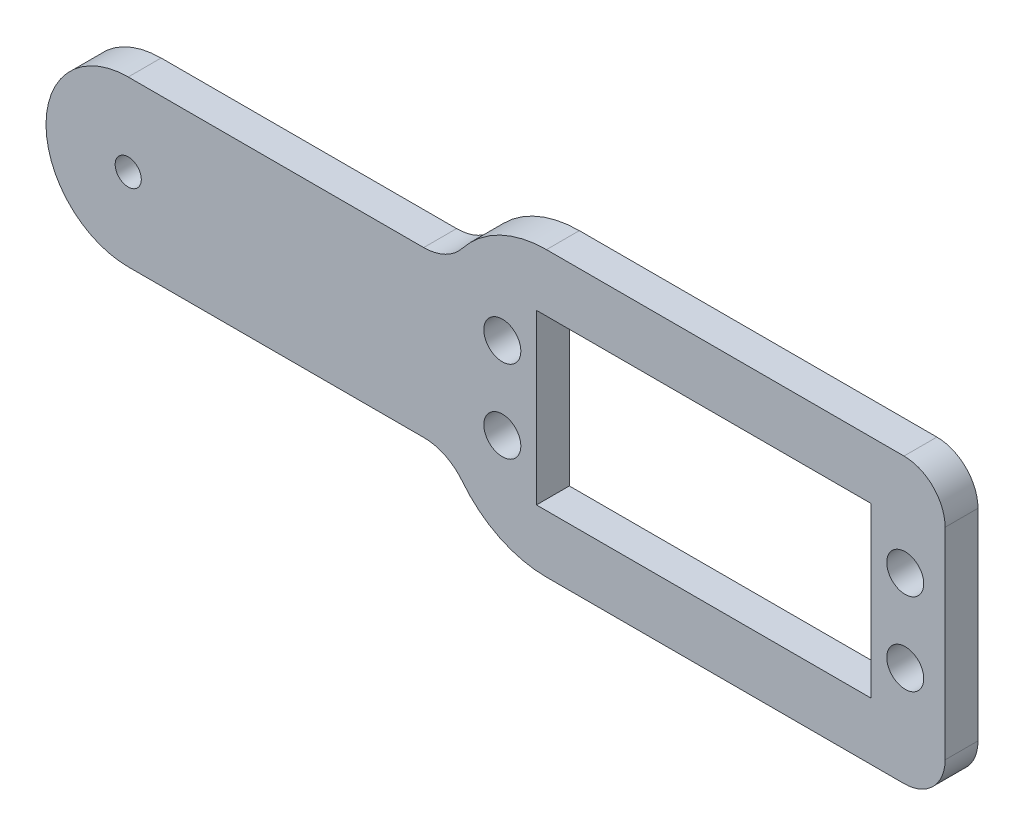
ISO-10303-21;
HEADER;
FILE_DESCRIPTION(('STEP AP214'),'2;1');
FILE_NAME('part.step','',(''),(''),'','','');
FILE_SCHEMA(('AUTOMOTIVE_DESIGN { 1 0 10303 214 1 1 1 1 }'));
ENDSEC;
DATA;
#1=APPLICATION_CONTEXT('core data for automotive mechanical design processes');
#2=APPLICATION_PROTOCOL_DEFINITION('international standard','automotive_design',2000,#1);
#3=PRODUCT_CONTEXT('',#1,'mechanical');
#4=PRODUCT('Part','Part','',(#3));
#5=PRODUCT_RELATED_PRODUCT_CATEGORY('part','',(#4));
#6=PRODUCT_DEFINITION_FORMATION('','',#4);
#7=PRODUCT_DEFINITION_CONTEXT('part definition',#1,'design');
#8=PRODUCT_DEFINITION('design','',#6,#7);
#9=PRODUCT_DEFINITION_SHAPE('','',#8);
#10=(LENGTH_UNIT() NAMED_UNIT(*) SI_UNIT(.MILLI.,.METRE.));
#11=(NAMED_UNIT(*) PLANE_ANGLE_UNIT() SI_UNIT($,.RADIAN.));
#12=(NAMED_UNIT(*) SI_UNIT($,.STERADIAN.) SOLID_ANGLE_UNIT());
#13=UNCERTAINTY_MEASURE_WITH_UNIT(LENGTH_MEASURE(1.E-05),#10,'distance_accuracy_value','');
#14=(GEOMETRIC_REPRESENTATION_CONTEXT(3) GLOBAL_UNCERTAINTY_ASSIGNED_CONTEXT((#13)) GLOBAL_UNIT_ASSIGNED_CONTEXT((#10,
#11,#12)) REPRESENTATION_CONTEXT('',''));
#15=CARTESIAN_POINT('',(0.,0.,0.));
#16=DIRECTION('',(0.,0.,1.));
#17=DIRECTION('',(1.,0.,0.));
#18=AXIS2_PLACEMENT_3D('',#15,#16,#17);
#19=CARTESIAN_POINT('',(-34.0650815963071,-16.,4.));
#20=DIRECTION('',(0.,0.,1.));
#21=DIRECTION('',(1.,0.,0.));
#22=AXIS2_PLACEMENT_3D('',#19,#20,#21);
#23=PLANE('',#22);
#24=CARTESIAN_POINT('',(-24.5,5.,4.));
#25=DIRECTION('',(0.,0.,1.));
#26=DIRECTION('',(1.,0.,0.));
#27=AXIS2_PLACEMENT_3D('',#24,#25,#26);
#28=CIRCLE('',#27,2.25);
#29=CARTESIAN_POINT('',(-22.25,5.,4.));
#30=VERTEX_POINT('',#29);
#31=EDGE_CURVE('E535',#30,#30,#28,.T.);
#32=ORIENTED_EDGE('',*,*,#31,.F.);
#33=EDGE_LOOP('',(#32));
#34=FACE_BOUND('',#33,.T.);
#35=CARTESIAN_POINT('',(-24.5,-5.,4.));
#36=DIRECTION('',(0.,0.,1.));
#37=DIRECTION('',(1.,0.,0.));
#38=AXIS2_PLACEMENT_3D('',#35,#36,#37);
#39=CIRCLE('',#38,2.25);
#40=CARTESIAN_POINT('',(-22.25,-5.,4.));
#41=VERTEX_POINT('',#40);
#42=EDGE_CURVE('E547',#41,#41,#39,.T.);
#43=ORIENTED_EDGE('',*,*,#42,.F.);
#44=EDGE_LOOP('',(#43));
#45=FACE_BOUND('',#44,.T.);
#46=DIRECTION('',(1.,0.,0.));
#47=VECTOR('',#46,1.);
#48=CARTESIAN_POINT('',(20.35,-10.25,4.));
#49=LINE('',#48,#47);
#50=CARTESIAN_POINT('',(-20.35,-10.25,4.));
#51=VERTEX_POINT('',#50);
#52=CARTESIAN_POINT('',(20.35,-10.25,4.));
#53=VERTEX_POINT('',#52);
#54=EDGE_CURVE('E153',#51,#53,#49,.T.);
#55=ORIENTED_EDGE('',*,*,#54,.F.);
#56=DIRECTION('',(0.,-1.,0.));
#57=VECTOR('',#56,1.);
#58=CARTESIAN_POINT('',(-20.35,10.25,4.));
#59=LINE('',#58,#57);
#60=CARTESIAN_POINT('',(-20.35,10.25,4.));
#61=VERTEX_POINT('',#60);
#62=EDGE_CURVE('E145',#61,#51,#59,.T.);
#63=ORIENTED_EDGE('',*,*,#62,.F.);
#64=DIRECTION('',(-1.,0.,0.));
#65=VECTOR('',#64,1.);
#66=CARTESIAN_POINT('',(20.35,10.25,4.));
#67=LINE('',#66,#65);
#68=CARTESIAN_POINT('',(20.35,10.25,4.));
#69=VERTEX_POINT('',#68);
#70=EDGE_CURVE('E168',#69,#61,#67,.T.);
#71=ORIENTED_EDGE('',*,*,#70,.F.);
#72=DIRECTION('',(0.,1.,0.));
#73=VECTOR('',#72,1.);
#74=CARTESIAN_POINT('',(20.35,10.25,4.));
#75=LINE('',#74,#73);
#76=EDGE_CURVE('E166',#53,#69,#75,.T.);
#77=ORIENTED_EDGE('',*,*,#76,.F.);
#78=EDGE_LOOP('',(#55,#63,#71,#77));
#79=FACE_BOUND('',#78,.T.);
#80=CARTESIAN_POINT('',(-34.0650815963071,-16.,4.));
#81=DIRECTION('',(0.,0.,-1.));
#82=DIRECTION('',(1.,0.,0.));
#83=AXIS2_PLACEMENT_3D('',#80,#81,#82);
#84=CIRCLE('',#83,6.);
#85=CARTESIAN_POINT('',(-34.0650815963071,-10.,4.));
#86=VERTEX_POINT('',#85);
#87=CARTESIAN_POINT('',(-29.35,-12.2894736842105,4.));
#88=VERTEX_POINT('',#87);
#89=EDGE_CURVE('E184',#86,#88,#84,.T.);
#90=ORIENTED_EDGE('',*,*,#89,.T.);
#91=CARTESIAN_POINT('',(-19.133989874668,-4.25,4.));
#92=DIRECTION('',(0.,0.,1.));
#93=DIRECTION('',(-1.,0.,0.));
#94=AXIS2_PLACEMENT_3D('',#91,#92,#93);
#95=CIRCLE('',#94,13.);
#96=CARTESIAN_POINT('',(-19.133989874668,-17.25,4.));
#97=VERTEX_POINT('',#96);
#98=EDGE_CURVE('E187',#88,#97,#95,.T.);
#99=ORIENTED_EDGE('',*,*,#98,.T.);
#100=DIRECTION('',(1.,0.,0.));
#101=VECTOR('',#100,1.);
#102=CARTESIAN_POINT('',(24.35,-17.25,4.));
#103=LINE('',#102,#101);
#104=CARTESIAN_POINT('',(24.35,-17.25,4.));
#105=VERTEX_POINT('',#104);
#106=EDGE_CURVE('E190',#97,#105,#103,.T.);
#107=ORIENTED_EDGE('',*,*,#106,.T.);
#108=CARTESIAN_POINT('',(24.35,-12.25,4.));
#109=DIRECTION('',(0.,0.,1.));
#110=DIRECTION('',(-1.,0.,0.));
#111=AXIS2_PLACEMENT_3D('',#108,#109,#110);
#112=CIRCLE('',#111,5.);
#113=CARTESIAN_POINT('',(29.35,-12.25,4.));
#114=VERTEX_POINT('',#113);
#115=EDGE_CURVE('E192',#105,#114,#112,.T.);
#116=ORIENTED_EDGE('',*,*,#115,.T.);
#117=DIRECTION('',(0.,1.,0.));
#118=VECTOR('',#117,1.);
#119=CARTESIAN_POINT('',(29.35,-12.25,4.));
#120=LINE('',#119,#118);
#121=CARTESIAN_POINT('',(29.35,12.25,4.));
#122=VERTEX_POINT('',#121);
#123=EDGE_CURVE('E194',#114,#122,#120,.T.);
#124=ORIENTED_EDGE('',*,*,#123,.T.);
#125=CARTESIAN_POINT('',(24.35,12.25,4.));
#126=DIRECTION('',(0.,0.,1.));
#127=DIRECTION('',(1.,0.,0.));
#128=AXIS2_PLACEMENT_3D('',#125,#126,#127);
#129=CIRCLE('',#128,5.);
#130=CARTESIAN_POINT('',(24.35,17.25,4.));
#131=VERTEX_POINT('',#130);
#132=EDGE_CURVE('E196',#122,#131,#129,.T.);
#133=ORIENTED_EDGE('',*,*,#132,.T.);
#134=DIRECTION('',(-1.,0.,0.));
#135=VECTOR('',#134,1.);
#136=CARTESIAN_POINT('',(24.35,17.25,4.));
#137=LINE('',#136,#135);
#138=CARTESIAN_POINT('',(-19.133989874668,17.25,4.));
#139=VERTEX_POINT('',#138);
#140=EDGE_CURVE('E198',#131,#139,#137,.T.);
#141=ORIENTED_EDGE('',*,*,#140,.T.);
#142=CARTESIAN_POINT('',(-19.133989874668,4.25,4.));
#143=DIRECTION('',(0.,0.,1.));
#144=DIRECTION('',(1.,0.,0.));
#145=AXIS2_PLACEMENT_3D('',#142,#143,#144);
#146=CIRCLE('',#145,13.);
#147=CARTESIAN_POINT('',(-29.35,12.2894736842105,4.));
#148=VERTEX_POINT('',#147);
#149=EDGE_CURVE('E200',#139,#148,#146,.T.);
#150=ORIENTED_EDGE('',*,*,#149,.T.);
#151=CARTESIAN_POINT('',(-34.0650815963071,16.,4.));
#152=DIRECTION('',(0.,0.,-1.));
#153=DIRECTION('',(-1.,0.,0.));
#154=AXIS2_PLACEMENT_3D('',#151,#152,#153);
#155=CIRCLE('',#154,6.);
#156=CARTESIAN_POINT('',(-34.0650815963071,10.,4.));
#157=VERTEX_POINT('',#156);
#158=EDGE_CURVE('E202',#148,#157,#155,.T.);
#159=ORIENTED_EDGE('',*,*,#158,.T.);
#160=DIRECTION('',(-1.,0.,0.));
#161=VECTOR('',#160,1.);
#162=CARTESIAN_POINT('',(-34.0650815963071,10.,4.));
#163=LINE('',#162,#161);
#164=CARTESIAN_POINT('',(-70.,10.,4.));
#165=VERTEX_POINT('',#164);
#166=EDGE_CURVE('E204',#157,#165,#163,.T.);
#167=ORIENTED_EDGE('',*,*,#166,.T.);
#168=CARTESIAN_POINT('',(-70.,0.,4.));
#169=DIRECTION('',(0.,0.,1.));
#170=DIRECTION('',(1.,0.,0.));
#171=AXIS2_PLACEMENT_3D('',#168,#169,#170);
#172=CIRCLE('',#171,10.);
#173=CARTESIAN_POINT('',(-70.,-10.,4.));
#174=VERTEX_POINT('',#173);
#175=EDGE_CURVE('E206',#165,#174,#172,.T.);
#176=ORIENTED_EDGE('',*,*,#175,.T.);
#177=DIRECTION('',(1.,0.,0.));
#178=VECTOR('',#177,1.);
#179=CARTESIAN_POINT('',(-34.0650815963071,-10.,4.));
#180=LINE('',#179,#178);
#181=EDGE_CURVE('E208',#174,#86,#180,.T.);
#182=ORIENTED_EDGE('',*,*,#181,.T.);
#183=EDGE_LOOP('',(#90,#99,#107,#116,#124,#133,#141,#150,#159,#167,#176,#182));
#184=FACE_BOUND('',#183,.T.);
#185=CARTESIAN_POINT('',(-70.,0.,4.));
#186=DIRECTION('',(0.,0.,1.));
#187=DIRECTION('',(1.,0.,0.));
#188=AXIS2_PLACEMENT_3D('',#185,#186,#187);
#189=CIRCLE('',#188,1.58999999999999);
#190=CARTESIAN_POINT('',(-68.41,0.,4.));
#191=VERTEX_POINT('',#190);
#192=EDGE_CURVE('E174',#191,#191,#189,.T.);
#193=ORIENTED_EDGE('',*,*,#192,.F.);
#194=EDGE_LOOP('',(#193));
#195=FACE_BOUND('',#194,.T.);
#196=CARTESIAN_POINT('',(24.5,-5.,4.));
#197=DIRECTION('',(0.,0.,1.));
#198=DIRECTION('',(1.,0.,0.));
#199=AXIS2_PLACEMENT_3D('',#196,#197,#198);
#200=CIRCLE('',#199,2.25);
#201=CARTESIAN_POINT('',(26.75,-5.,4.));
#202=VERTEX_POINT('',#201);
#203=EDGE_CURVE('E541',#202,#202,#200,.T.);
#204=ORIENTED_EDGE('',*,*,#203,.F.);
#205=EDGE_LOOP('',(#204));
#206=FACE_BOUND('',#205,.T.);
#207=CARTESIAN_POINT('',(24.5,5.,4.));
#208=DIRECTION('',(0.,0.,1.));
#209=DIRECTION('',(1.,0.,0.));
#210=AXIS2_PLACEMENT_3D('',#207,#208,#209);
#211=CIRCLE('',#210,2.25);
#212=CARTESIAN_POINT('',(26.75,5.,4.));
#213=VERTEX_POINT('',#212);
#214=EDGE_CURVE('E526',#213,#213,#211,.T.);
#215=ORIENTED_EDGE('',*,*,#214,.F.);
#216=EDGE_LOOP('',(#215));
#217=FACE_BOUND('',#216,.T.);
#218=ADVANCED_FACE('F32',(#34,#45,#79,#184,#195,#206,#217),#23,.T.);
#219=CARTESIAN_POINT('',(-34.0650815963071,-16.,0.));
#220=DIRECTION('',(0.,0.,1.));
#221=DIRECTION('',(1.,0.,0.));
#222=AXIS2_PLACEMENT_3D('',#219,#220,#221);
#223=PLANE('',#222);
#224=CARTESIAN_POINT('',(-24.5,5.,0.));
#225=DIRECTION('',(0.,0.,1.));
#226=DIRECTION('',(1.,0.,0.));
#227=AXIS2_PLACEMENT_3D('',#224,#225,#226);
#228=CIRCLE('',#227,2.25);
#229=CARTESIAN_POINT('',(-22.25,5.,0.));
#230=VERTEX_POINT('',#229);
#231=EDGE_CURVE('E532',#230,#230,#228,.T.);
#232=ORIENTED_EDGE('',*,*,#231,.T.);
#233=EDGE_LOOP('',(#232));
#234=FACE_BOUND('',#233,.T.);
#235=CARTESIAN_POINT('',(-24.5,-5.,0.));
#236=DIRECTION('',(0.,0.,1.));
#237=DIRECTION('',(1.,0.,0.));
#238=AXIS2_PLACEMENT_3D('',#235,#236,#237);
#239=CIRCLE('',#238,2.25);
#240=CARTESIAN_POINT('',(-22.25,-5.,0.));
#241=VERTEX_POINT('',#240);
#242=EDGE_CURVE('E544',#241,#241,#239,.T.);
#243=ORIENTED_EDGE('',*,*,#242,.T.);
#244=EDGE_LOOP('',(#243));
#245=FACE_BOUND('',#244,.T.);
#246=DIRECTION('',(0.,-1.,0.));
#247=VECTOR('',#246,1.);
#248=CARTESIAN_POINT('',(-20.35,10.25,0.));
#249=LINE('',#248,#247);
#250=CARTESIAN_POINT('',(-20.35,10.25,0.));
#251=VERTEX_POINT('',#250);
#252=CARTESIAN_POINT('',(-20.35,-10.25,0.));
#253=VERTEX_POINT('',#252);
#254=EDGE_CURVE('E55',#251,#253,#249,.T.);
#255=ORIENTED_EDGE('',*,*,#254,.T.);
#256=DIRECTION('',(1.,0.,0.));
#257=VECTOR('',#256,1.);
#258=CARTESIAN_POINT('',(20.35,-10.25,0.));
#259=LINE('',#258,#257);
#260=CARTESIAN_POINT('',(20.35,-10.25,0.));
#261=VERTEX_POINT('',#260);
#262=EDGE_CURVE('E160',#253,#261,#259,.T.);
#263=ORIENTED_EDGE('',*,*,#262,.T.);
#264=DIRECTION('',(0.,1.,0.));
#265=VECTOR('',#264,1.);
#266=CARTESIAN_POINT('',(20.35,10.25,0.));
#267=LINE('',#266,#265);
#268=CARTESIAN_POINT('',(20.35,10.25,0.));
#269=VERTEX_POINT('',#268);
#270=EDGE_CURVE('E176',#261,#269,#267,.T.);
#271=ORIENTED_EDGE('',*,*,#270,.T.);
#272=DIRECTION('',(-1.,0.,0.));
#273=VECTOR('',#272,1.);
#274=CARTESIAN_POINT('',(20.35,10.25,0.));
#275=LINE('',#274,#273);
#276=EDGE_CURVE('E154',#269,#251,#275,.T.);
#277=ORIENTED_EDGE('',*,*,#276,.T.);
#278=EDGE_LOOP('',(#255,#263,#271,#277));
#279=FACE_BOUND('',#278,.T.);
#280=CARTESIAN_POINT('',(-34.0650815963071,-16.,0.));
#281=DIRECTION('',(0.,0.,-1.));
#282=DIRECTION('',(1.,0.,0.));
#283=AXIS2_PLACEMENT_3D('',#280,#281,#282);
#284=CIRCLE('',#283,6.);
#285=CARTESIAN_POINT('',(-34.0650815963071,-10.,0.));
#286=VERTEX_POINT('',#285);
#287=CARTESIAN_POINT('',(-29.35,-12.2894736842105,0.));
#288=VERTEX_POINT('',#287);
#289=EDGE_CURVE('E161',#286,#288,#284,.T.);
#290=ORIENTED_EDGE('',*,*,#289,.F.);
#291=DIRECTION('',(1.,0.,0.));
#292=VECTOR('',#291,1.);
#293=CARTESIAN_POINT('',(-34.0650815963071,-10.,0.));
#294=LINE('',#293,#292);
#295=CARTESIAN_POINT('',(-70.,-10.,0.));
#296=VERTEX_POINT('',#295);
#297=EDGE_CURVE('E188',#296,#286,#294,.T.);
#298=ORIENTED_EDGE('',*,*,#297,.F.);
#299=CARTESIAN_POINT('',(-70.,0.,0.));
#300=DIRECTION('',(0.,0.,1.));
#301=DIRECTION('',(1.,0.,0.));
#302=AXIS2_PLACEMENT_3D('',#299,#300,#301);
#303=CIRCLE('',#302,10.);
#304=CARTESIAN_POINT('',(-70.,10.,0.));
#305=VERTEX_POINT('',#304);
#306=EDGE_CURVE('E231',#305,#296,#303,.T.);
#307=ORIENTED_EDGE('',*,*,#306,.F.);
#308=DIRECTION('',(-1.,0.,0.));
#309=VECTOR('',#308,1.);
#310=CARTESIAN_POINT('',(-34.0650815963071,10.,0.));
#311=LINE('',#310,#309);
#312=CARTESIAN_POINT('',(-34.0650815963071,10.,0.));
#313=VERTEX_POINT('',#312);
#314=EDGE_CURVE('E229',#313,#305,#311,.T.);
#315=ORIENTED_EDGE('',*,*,#314,.F.);
#316=CARTESIAN_POINT('',(-34.0650815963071,16.,0.));
#317=DIRECTION('',(0.,0.,-1.));
#318=DIRECTION('',(-1.,0.,0.));
#319=AXIS2_PLACEMENT_3D('',#316,#317,#318);
#320=CIRCLE('',#319,6.);
#321=CARTESIAN_POINT('',(-29.35,12.2894736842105,0.));
#322=VERTEX_POINT('',#321);
#323=EDGE_CURVE('E227',#322,#313,#320,.T.);
#324=ORIENTED_EDGE('',*,*,#323,.F.);
#325=CARTESIAN_POINT('',(-19.133989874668,4.25,0.));
#326=DIRECTION('',(0.,0.,1.));
#327=DIRECTION('',(1.,0.,0.));
#328=AXIS2_PLACEMENT_3D('',#325,#326,#327);
#329=CIRCLE('',#328,13.);
#330=CARTESIAN_POINT('',(-19.133989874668,17.25,0.));
#331=VERTEX_POINT('',#330);
#332=EDGE_CURVE('E225',#331,#322,#329,.T.);
#333=ORIENTED_EDGE('',*,*,#332,.F.);
#334=DIRECTION('',(-1.,0.,0.));
#335=VECTOR('',#334,1.);
#336=CARTESIAN_POINT('',(24.35,17.25,0.));
#337=LINE('',#336,#335);
#338=CARTESIAN_POINT('',(24.35,17.25,0.));
#339=VERTEX_POINT('',#338);
#340=EDGE_CURVE('E223',#339,#331,#337,.T.);
#341=ORIENTED_EDGE('',*,*,#340,.F.);
#342=CARTESIAN_POINT('',(24.35,12.25,0.));
#343=DIRECTION('',(0.,0.,1.));
#344=DIRECTION('',(1.,0.,0.));
#345=AXIS2_PLACEMENT_3D('',#342,#343,#344);
#346=CIRCLE('',#345,5.);
#347=CARTESIAN_POINT('',(29.35,12.25,0.));
#348=VERTEX_POINT('',#347);
#349=EDGE_CURVE('E221',#348,#339,#346,.T.);
#350=ORIENTED_EDGE('',*,*,#349,.F.);
#351=DIRECTION('',(0.,1.,0.));
#352=VECTOR('',#351,1.);
#353=CARTESIAN_POINT('',(29.35,-12.25,0.));
#354=LINE('',#353,#352);
#355=CARTESIAN_POINT('',(29.35,-12.25,0.));
#356=VERTEX_POINT('',#355);
#357=EDGE_CURVE('E219',#356,#348,#354,.T.);
#358=ORIENTED_EDGE('',*,*,#357,.F.);
#359=CARTESIAN_POINT('',(24.35,-12.25,0.));
#360=DIRECTION('',(0.,0.,1.));
#361=DIRECTION('',(-1.,0.,0.));
#362=AXIS2_PLACEMENT_3D('',#359,#360,#361);
#363=CIRCLE('',#362,5.);
#364=CARTESIAN_POINT('',(24.35,-17.25,0.));
#365=VERTEX_POINT('',#364);
#366=EDGE_CURVE('E217',#365,#356,#363,.T.);
#367=ORIENTED_EDGE('',*,*,#366,.F.);
#368=DIRECTION('',(1.,0.,0.));
#369=VECTOR('',#368,1.);
#370=CARTESIAN_POINT('',(24.35,-17.25,0.));
#371=LINE('',#370,#369);
#372=CARTESIAN_POINT('',(-19.133989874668,-17.25,0.));
#373=VERTEX_POINT('',#372);
#374=EDGE_CURVE('E215',#373,#365,#371,.T.);
#375=ORIENTED_EDGE('',*,*,#374,.F.);
#376=CARTESIAN_POINT('',(-19.133989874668,-4.25,0.));
#377=DIRECTION('',(0.,0.,1.));
#378=DIRECTION('',(-1.,0.,0.));
#379=AXIS2_PLACEMENT_3D('',#376,#377,#378);
#380=CIRCLE('',#379,13.);
#381=EDGE_CURVE('E213',#288,#373,#380,.T.);
#382=ORIENTED_EDGE('',*,*,#381,.F.);
#383=EDGE_LOOP('',(#290,#298,#307,#315,#324,#333,#341,#350,#358,#367,#375,#382));
#384=FACE_BOUND('',#383,.T.);
#385=CARTESIAN_POINT('',(-70.,0.,0.));
#386=DIRECTION('',(0.,0.,1.));
#387=DIRECTION('',(1.,0.,0.));
#388=AXIS2_PLACEMENT_3D('',#385,#386,#387);
#389=CIRCLE('',#388,1.58999999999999);
#390=CARTESIAN_POINT('',(-68.41,0.,0.));
#391=VERTEX_POINT('',#390);
#392=EDGE_CURVE('E550',#391,#391,#389,.T.);
#393=ORIENTED_EDGE('',*,*,#392,.T.);
#394=EDGE_LOOP('',(#393));
#395=FACE_BOUND('',#394,.T.);
#396=CARTESIAN_POINT('',(24.5,-5.,0.));
#397=DIRECTION('',(0.,0.,1.));
#398=DIRECTION('',(1.,0.,0.));
#399=AXIS2_PLACEMENT_3D('',#396,#397,#398);
#400=CIRCLE('',#399,2.25);
#401=CARTESIAN_POINT('',(26.75,-5.,0.));
#402=VERTEX_POINT('',#401);
#403=EDGE_CURVE('E538',#402,#402,#400,.T.);
#404=ORIENTED_EDGE('',*,*,#403,.T.);
#405=EDGE_LOOP('',(#404));
#406=FACE_BOUND('',#405,.T.);
#407=CARTESIAN_POINT('',(24.5,5.,0.));
#408=DIRECTION('',(0.,0.,1.));
#409=DIRECTION('',(1.,0.,0.));
#410=AXIS2_PLACEMENT_3D('',#407,#408,#409);
#411=CIRCLE('',#410,2.25);
#412=CARTESIAN_POINT('',(26.75,5.,0.));
#413=VERTEX_POINT('',#412);
#414=EDGE_CURVE('E529',#413,#413,#411,.T.);
#415=ORIENTED_EDGE('',*,*,#414,.T.);
#416=EDGE_LOOP('',(#415));
#417=FACE_BOUND('',#416,.T.);
#418=ADVANCED_FACE('F273',(#234,#245,#279,#384,#395,#406,#417),#223,.F.);
#419=CARTESIAN_POINT('',(-34.0650815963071,-16.,4.));
#420=DIRECTION('',(0.,0.,-1.));
#421=DIRECTION('',(-1.,0.,0.));
#422=AXIS2_PLACEMENT_3D('',#419,#420,#421);
#423=CYLINDRICAL_SURFACE('',#422,6.);
#424=ORIENTED_EDGE('',*,*,#289,.T.);
#425=DIRECTION('',(0.,0.,-1.));
#426=VECTOR('',#425,1.);
#427=CARTESIAN_POINT('',(-29.35,-12.2894736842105,4.));
#428=LINE('',#427,#426);
#429=EDGE_CURVE('E11',#88,#288,#428,.T.);
#430=ORIENTED_EDGE('',*,*,#429,.F.);
#431=ORIENTED_EDGE('',*,*,#89,.F.);
#432=DIRECTION('',(0.,0.,-1.));
#433=VECTOR('',#432,1.);
#434=CARTESIAN_POINT('',(-34.0650815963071,-10.,4.));
#435=LINE('',#434,#433);
#436=EDGE_CURVE('E210',#86,#286,#435,.T.);
#437=ORIENTED_EDGE('',*,*,#436,.T.);
#438=EDGE_LOOP('',(#424,#430,#431,#437));
#439=FACE_BOUND('',#438,.T.);
#440=ADVANCED_FACE('F34',(#439),#423,.F.);
#441=CARTESIAN_POINT('',(-19.133989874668,-4.25,4.));
#442=DIRECTION('',(0.,0.,-1.));
#443=DIRECTION('',(-1.,0.,0.));
#444=AXIS2_PLACEMENT_3D('',#441,#442,#443);
#445=CYLINDRICAL_SURFACE('',#444,13.);
#446=ORIENTED_EDGE('',*,*,#381,.T.);
#447=DIRECTION('',(0.,0.,-1.));
#448=VECTOR('',#447,1.);
#449=CARTESIAN_POINT('',(-19.133989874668,-17.25,4.));
#450=LINE('',#449,#448);
#451=EDGE_CURVE('E40',#97,#373,#450,.T.);
#452=ORIENTED_EDGE('',*,*,#451,.F.);
#453=ORIENTED_EDGE('',*,*,#98,.F.);
#454=ORIENTED_EDGE('',*,*,#429,.T.);
#455=EDGE_LOOP('',(#446,#452,#453,#454));
#456=FACE_BOUND('',#455,.T.);
#457=ADVANCED_FACE('F290',(#456),#445,.T.);
#458=CARTESIAN_POINT('',(24.35,-17.25,4.));
#459=DIRECTION('',(0.,1.,0.));
#460=DIRECTION('',(-1.,0.,0.));
#461=AXIS2_PLACEMENT_3D('',#458,#459,#460);
#462=PLANE('',#461);
#463=ORIENTED_EDGE('',*,*,#374,.T.);
#464=DIRECTION('',(0.,0.,-1.));
#465=VECTOR('',#464,1.);
#466=CARTESIAN_POINT('',(24.35,-17.25,4.));
#467=LINE('',#466,#465);
#468=EDGE_CURVE('E260',#105,#365,#467,.T.);
#469=ORIENTED_EDGE('',*,*,#468,.F.);
#470=ORIENTED_EDGE('',*,*,#106,.F.);
#471=ORIENTED_EDGE('',*,*,#451,.T.);
#472=EDGE_LOOP('',(#463,#469,#470,#471));
#473=FACE_BOUND('',#472,.T.);
#474=ADVANCED_FACE('F267',(#473),#462,.F.);
#475=CARTESIAN_POINT('',(24.35,-12.25,4.));
#476=DIRECTION('',(0.,0.,-1.));
#477=DIRECTION('',(-1.,0.,0.));
#478=AXIS2_PLACEMENT_3D('',#475,#476,#477);
#479=CYLINDRICAL_SURFACE('',#478,5.);
#480=ORIENTED_EDGE('',*,*,#366,.T.);
#481=DIRECTION('',(0.,0.,-1.));
#482=VECTOR('',#481,1.);
#483=CARTESIAN_POINT('',(29.35,-12.25,4.));
#484=LINE('',#483,#482);
#485=EDGE_CURVE('E257',#114,#356,#484,.T.);
#486=ORIENTED_EDGE('',*,*,#485,.F.);
#487=ORIENTED_EDGE('',*,*,#115,.F.);
#488=ORIENTED_EDGE('',*,*,#468,.T.);
#489=EDGE_LOOP('',(#480,#486,#487,#488));
#490=FACE_BOUND('',#489,.T.);
#491=ADVANCED_FACE('F279',(#490),#479,.T.);
#492=CARTESIAN_POINT('',(29.35,-12.25,4.));
#493=DIRECTION('',(-1.,0.,0.));
#494=DIRECTION('',(0.,0.,1.));
#495=AXIS2_PLACEMENT_3D('',#492,#493,#494);
#496=PLANE('',#495);
#497=ORIENTED_EDGE('',*,*,#357,.T.);
#498=DIRECTION('',(0.,0.,-1.));
#499=VECTOR('',#498,1.);
#500=CARTESIAN_POINT('',(29.35,12.25,4.));
#501=LINE('',#500,#499);
#502=EDGE_CURVE('E254',#122,#348,#501,.T.);
#503=ORIENTED_EDGE('',*,*,#502,.F.);
#504=ORIENTED_EDGE('',*,*,#123,.F.);
#505=ORIENTED_EDGE('',*,*,#485,.T.);
#506=EDGE_LOOP('',(#497,#503,#504,#505));
#507=FACE_BOUND('',#506,.T.);
#508=ADVANCED_FACE('F283',(#507),#496,.F.);
#509=CARTESIAN_POINT('',(24.35,12.25,4.));
#510=DIRECTION('',(0.,0.,-1.));
#511=DIRECTION('',(-1.,0.,0.));
#512=AXIS2_PLACEMENT_3D('',#509,#510,#511);
#513=CYLINDRICAL_SURFACE('',#512,5.);
#514=ORIENTED_EDGE('',*,*,#349,.T.);
#515=DIRECTION('',(0.,0.,-1.));
#516=VECTOR('',#515,1.);
#517=CARTESIAN_POINT('',(24.35,17.25,4.));
#518=LINE('',#517,#516);
#519=EDGE_CURVE('E251',#131,#339,#518,.T.);
#520=ORIENTED_EDGE('',*,*,#519,.F.);
#521=ORIENTED_EDGE('',*,*,#132,.F.);
#522=ORIENTED_EDGE('',*,*,#502,.T.);
#523=EDGE_LOOP('',(#514,#520,#521,#522));
#524=FACE_BOUND('',#523,.T.);
#525=ADVANCED_FACE('F323',(#524),#513,.T.);
#526=CARTESIAN_POINT('',(24.35,17.25,4.));
#527=DIRECTION('',(0.,-1.,0.));
#528=DIRECTION('',(1.,0.,0.));
#529=AXIS2_PLACEMENT_3D('',#526,#527,#528);
#530=PLANE('',#529);
#531=ORIENTED_EDGE('',*,*,#340,.T.);
#532=DIRECTION('',(0.,0.,-1.));
#533=VECTOR('',#532,1.);
#534=CARTESIAN_POINT('',(-19.133989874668,17.25,4.));
#535=LINE('',#534,#533);
#536=EDGE_CURVE('E248',#139,#331,#535,.T.);
#537=ORIENTED_EDGE('',*,*,#536,.F.);
#538=ORIENTED_EDGE('',*,*,#140,.F.);
#539=ORIENTED_EDGE('',*,*,#519,.T.);
#540=EDGE_LOOP('',(#531,#537,#538,#539));
#541=FACE_BOUND('',#540,.T.);
#542=ADVANCED_FACE('F321',(#541),#530,.F.);
#543=CARTESIAN_POINT('',(-19.133989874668,4.25,4.));
#544=DIRECTION('',(0.,0.,-1.));
#545=DIRECTION('',(-1.,0.,0.));
#546=AXIS2_PLACEMENT_3D('',#543,#544,#545);
#547=CYLINDRICAL_SURFACE('',#546,13.);
#548=ORIENTED_EDGE('',*,*,#332,.T.);
#549=DIRECTION('',(0.,0.,-1.));
#550=VECTOR('',#549,1.);
#551=CARTESIAN_POINT('',(-29.35,12.2894736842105,4.));
#552=LINE('',#551,#550);
#553=EDGE_CURVE('E245',#148,#322,#552,.T.);
#554=ORIENTED_EDGE('',*,*,#553,.F.);
#555=ORIENTED_EDGE('',*,*,#149,.F.);
#556=ORIENTED_EDGE('',*,*,#536,.T.);
#557=EDGE_LOOP('',(#548,#554,#555,#556));
#558=FACE_BOUND('',#557,.T.);
#559=ADVANCED_FACE('F317',(#558),#547,.T.);
#560=CARTESIAN_POINT('',(-34.0650815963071,16.,4.));
#561=DIRECTION('',(0.,0.,-1.));
#562=DIRECTION('',(-1.,0.,0.));
#563=AXIS2_PLACEMENT_3D('',#560,#561,#562);
#564=CYLINDRICAL_SURFACE('',#563,6.);
#565=ORIENTED_EDGE('',*,*,#323,.T.);
#566=DIRECTION('',(0.,0.,-1.));
#567=VECTOR('',#566,1.);
#568=CARTESIAN_POINT('',(-34.0650815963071,10.,4.));
#569=LINE('',#568,#567);
#570=EDGE_CURVE('E242',#157,#313,#569,.T.);
#571=ORIENTED_EDGE('',*,*,#570,.F.);
#572=ORIENTED_EDGE('',*,*,#158,.F.);
#573=ORIENTED_EDGE('',*,*,#553,.T.);
#574=EDGE_LOOP('',(#565,#571,#572,#573));
#575=FACE_BOUND('',#574,.T.);
#576=ADVANCED_FACE('F312',(#575),#564,.F.);
#577=CARTESIAN_POINT('',(-34.0650815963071,10.,4.));
#578=DIRECTION('',(0.,-1.,0.));
#579=DIRECTION('',(1.,0.,0.));
#580=AXIS2_PLACEMENT_3D('',#577,#578,#579);
#581=PLANE('',#580);
#582=ORIENTED_EDGE('',*,*,#314,.T.);
#583=DIRECTION('',(0.,0.,-1.));
#584=VECTOR('',#583,1.);
#585=CARTESIAN_POINT('',(-70.,10.,4.));
#586=LINE('',#585,#584);
#587=EDGE_CURVE('E239',#165,#305,#586,.T.);
#588=ORIENTED_EDGE('',*,*,#587,.F.);
#589=ORIENTED_EDGE('',*,*,#166,.F.);
#590=ORIENTED_EDGE('',*,*,#570,.T.);
#591=EDGE_LOOP('',(#582,#588,#589,#590));
#592=FACE_BOUND('',#591,.T.);
#593=ADVANCED_FACE('F306',(#592),#581,.F.);
#594=CARTESIAN_POINT('',(-70.,0.,4.));
#595=DIRECTION('',(0.,0.,-1.));
#596=DIRECTION('',(-1.,0.,0.));
#597=AXIS2_PLACEMENT_3D('',#594,#595,#596);
#598=CYLINDRICAL_SURFACE('',#597,10.);
#599=ORIENTED_EDGE('',*,*,#306,.T.);
#600=DIRECTION('',(0.,0.,-1.));
#601=VECTOR('',#600,1.);
#602=CARTESIAN_POINT('',(-70.,-10.,4.));
#603=LINE('',#602,#601);
#604=EDGE_CURVE('E236',#174,#296,#603,.T.);
#605=ORIENTED_EDGE('',*,*,#604,.F.);
#606=ORIENTED_EDGE('',*,*,#175,.F.);
#607=ORIENTED_EDGE('',*,*,#587,.T.);
#608=EDGE_LOOP('',(#599,#605,#606,#607));
#609=FACE_BOUND('',#608,.T.);
#610=ADVANCED_FACE('F302',(#609),#598,.T.);
#611=CARTESIAN_POINT('',(-34.0650815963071,-10.,4.));
#612=DIRECTION('',(0.,1.,0.));
#613=DIRECTION('',(-1.,0.,0.));
#614=AXIS2_PLACEMENT_3D('',#611,#612,#613);
#615=PLANE('',#614);
#616=ORIENTED_EDGE('',*,*,#297,.T.);
#617=ORIENTED_EDGE('',*,*,#436,.F.);
#618=ORIENTED_EDGE('',*,*,#181,.F.);
#619=ORIENTED_EDGE('',*,*,#604,.T.);
#620=EDGE_LOOP('',(#616,#617,#618,#619));
#621=FACE_BOUND('',#620,.T.);
#622=ADVANCED_FACE('F297',(#621),#615,.F.);
#623=CARTESIAN_POINT('',(-20.35,10.25,4.));
#624=DIRECTION('',(1.,0.,0.));
#625=DIRECTION('',(0.,1.,0.));
#626=AXIS2_PLACEMENT_3D('',#623,#624,#625);
#627=PLANE('',#626);
#628=ORIENTED_EDGE('',*,*,#254,.F.);
#629=DIRECTION('',(0.,0.,-1.));
#630=VECTOR('',#629,1.);
#631=CARTESIAN_POINT('',(-20.35,10.25,4.));
#632=LINE('',#631,#630);
#633=EDGE_CURVE('E149',#61,#251,#632,.T.);
#634=ORIENTED_EDGE('',*,*,#633,.F.);
#635=ORIENTED_EDGE('',*,*,#62,.T.);
#636=DIRECTION('',(0.,0.,-1.));
#637=VECTOR('',#636,1.);
#638=CARTESIAN_POINT('',(-20.35,-10.25,4.));
#639=LINE('',#638,#637);
#640=EDGE_CURVE('E148',#51,#253,#639,.T.);
#641=ORIENTED_EDGE('',*,*,#640,.T.);
#642=EDGE_LOOP('',(#628,#634,#635,#641));
#643=FACE_BOUND('',#642,.T.);
#644=ADVANCED_FACE('F147',(#643),#627,.T.);
#645=CARTESIAN_POINT('',(20.35,-10.25,4.));
#646=DIRECTION('',(0.,1.,0.));
#647=DIRECTION('',(-1.,0.,0.));
#648=AXIS2_PLACEMENT_3D('',#645,#646,#647);
#649=PLANE('',#648);
#650=ORIENTED_EDGE('',*,*,#262,.F.);
#651=ORIENTED_EDGE('',*,*,#640,.F.);
#652=ORIENTED_EDGE('',*,*,#54,.T.);
#653=DIRECTION('',(0.,0.,-1.));
#654=VECTOR('',#653,1.);
#655=CARTESIAN_POINT('',(20.35,-10.25,4.));
#656=LINE('',#655,#654);
#657=EDGE_CURVE('E162',#53,#261,#656,.T.);
#658=ORIENTED_EDGE('',*,*,#657,.T.);
#659=EDGE_LOOP('',(#650,#651,#652,#658));
#660=FACE_BOUND('',#659,.T.);
#661=ADVANCED_FACE('F157',(#660),#649,.T.);
#662=CARTESIAN_POINT('',(20.35,10.25,4.));
#663=DIRECTION('',(-1.,0.,0.));
#664=DIRECTION('',(0.,-1.,0.));
#665=AXIS2_PLACEMENT_3D('',#662,#663,#664);
#666=PLANE('',#665);
#667=ORIENTED_EDGE('',*,*,#270,.F.);
#668=ORIENTED_EDGE('',*,*,#657,.F.);
#669=ORIENTED_EDGE('',*,*,#76,.T.);
#670=DIRECTION('',(0.,0.,-1.));
#671=VECTOR('',#670,1.);
#672=CARTESIAN_POINT('',(20.35,10.25,4.));
#673=LINE('',#672,#671);
#674=EDGE_CURVE('E47',#69,#269,#673,.T.);
#675=ORIENTED_EDGE('',*,*,#674,.T.);
#676=EDGE_LOOP('',(#667,#668,#669,#675));
#677=FACE_BOUND('',#676,.T.);
#678=ADVANCED_FACE('F385',(#677),#666,.T.);
#679=CARTESIAN_POINT('',(20.35,10.25,4.));
#680=DIRECTION('',(0.,-1.,0.));
#681=DIRECTION('',(1.,0.,0.));
#682=AXIS2_PLACEMENT_3D('',#679,#680,#681);
#683=PLANE('',#682);
#684=ORIENTED_EDGE('',*,*,#276,.F.);
#685=ORIENTED_EDGE('',*,*,#674,.F.);
#686=ORIENTED_EDGE('',*,*,#70,.T.);
#687=ORIENTED_EDGE('',*,*,#633,.T.);
#688=EDGE_LOOP('',(#684,#685,#686,#687));
#689=FACE_BOUND('',#688,.T.);
#690=ADVANCED_FACE('F391',(#689),#683,.T.);
#691=CARTESIAN_POINT('',(-70.,0.,4.));
#692=DIRECTION('',(0.,0.,-1.));
#693=DIRECTION('',(-1.,0.,0.));
#694=AXIS2_PLACEMENT_3D('',#691,#692,#693);
#695=CYLINDRICAL_SURFACE('',#694,1.58999999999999);
#696=ORIENTED_EDGE('',*,*,#192,.T.);
#697=EDGE_LOOP('',(#696));
#698=FACE_BOUND('',#697,.T.);
#699=ORIENTED_EDGE('',*,*,#392,.F.);
#700=EDGE_LOOP('',(#699));
#701=FACE_BOUND('',#700,.T.);
#702=ADVANCED_FACE('F399',(#698,#701),#695,.F.);
#703=CARTESIAN_POINT('',(-24.5,-5.,4.));
#704=DIRECTION('',(0.,0.,-1.));
#705=DIRECTION('',(-1.,0.,0.));
#706=AXIS2_PLACEMENT_3D('',#703,#704,#705);
#707=CYLINDRICAL_SURFACE('',#706,2.25);
#708=ORIENTED_EDGE('',*,*,#42,.T.);
#709=EDGE_LOOP('',(#708));
#710=FACE_BOUND('',#709,.T.);
#711=ORIENTED_EDGE('',*,*,#242,.F.);
#712=EDGE_LOOP('',(#711));
#713=FACE_BOUND('',#712,.T.);
#714=ADVANCED_FACE('F406',(#710,#713),#707,.F.);
#715=CARTESIAN_POINT('',(24.5,-5.,4.));
#716=DIRECTION('',(0.,0.,-1.));
#717=DIRECTION('',(-1.,0.,0.));
#718=AXIS2_PLACEMENT_3D('',#715,#716,#717);
#719=CYLINDRICAL_SURFACE('',#718,2.25);
#720=ORIENTED_EDGE('',*,*,#203,.T.);
#721=EDGE_LOOP('',(#720));
#722=FACE_BOUND('',#721,.T.);
#723=ORIENTED_EDGE('',*,*,#403,.F.);
#724=EDGE_LOOP('',(#723));
#725=FACE_BOUND('',#724,.T.);
#726=ADVANCED_FACE('F414',(#722,#725),#719,.F.);
#727=CARTESIAN_POINT('',(-24.5,5.,4.));
#728=DIRECTION('',(0.,0.,-1.));
#729=DIRECTION('',(-1.,0.,0.));
#730=AXIS2_PLACEMENT_3D('',#727,#728,#729);
#731=CYLINDRICAL_SURFACE('',#730,2.25);
#732=ORIENTED_EDGE('',*,*,#31,.T.);
#733=EDGE_LOOP('',(#732));
#734=FACE_BOUND('',#733,.T.);
#735=ORIENTED_EDGE('',*,*,#231,.F.);
#736=EDGE_LOOP('',(#735));
#737=FACE_BOUND('',#736,.T.);
#738=ADVANCED_FACE('F422',(#734,#737),#731,.F.);
#739=CARTESIAN_POINT('',(24.5,5.,4.));
#740=DIRECTION('',(0.,0.,-1.));
#741=DIRECTION('',(-1.,0.,0.));
#742=AXIS2_PLACEMENT_3D('',#739,#740,#741);
#743=CYLINDRICAL_SURFACE('',#742,2.25);
#744=ORIENTED_EDGE('',*,*,#214,.T.);
#745=EDGE_LOOP('',(#744));
#746=FACE_BOUND('',#745,.T.);
#747=ORIENTED_EDGE('',*,*,#414,.F.);
#748=EDGE_LOOP('',(#747));
#749=FACE_BOUND('',#748,.T.);
#750=ADVANCED_FACE('F430',(#746,#749),#743,.F.);
#751=CLOSED_SHELL('',(#218,#418,#440,#457,#474,#491,#508,#525,#542,#559,#576,#593,#610,#622,
#644,#661,#678,#690,#702,#714,#726,#738,#750));
#752=MANIFOLD_SOLID_BREP('B2',#751);
#753=ADVANCED_BREP_SHAPE_REPRESENTATION('',(#18,#752),#14);
#754=SHAPE_DEFINITION_REPRESENTATION(#9,#753);
ENDSEC;
END-ISO-10303-21;
